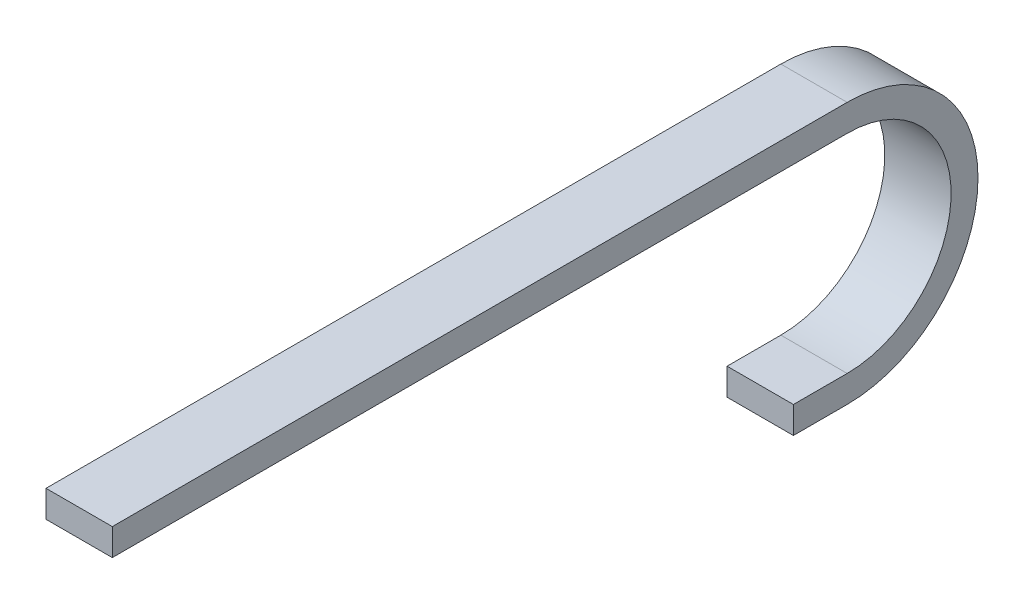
from build123d import *

# Parameters (mm, degrees)
ESQUISSE1_W = 37
ESQUISSE1_H = 15


with BuildPart() as part:
    # Balayage1: sweep along a path in Esquisse4
    with BuildLine(Plane(origin=(0, 0, 0), x_dir=(0, 0, -1), z_dir=(1, 0, 0))) as balayage1_path:
        Line((0, 0), (410, 0))
        ThreePointArc((410, 0), (475.5, -65.5), (410, -131))
        Line((410, -131), (380, -131))
    # Esquisse1 → Balayage1 (sweep)
    with BuildSketch(Plane.XY):
        Rectangle(ESQUISSE1_W, ESQUISSE1_H)
    sweep(path=balayage1_path.line)


solid = part.part
